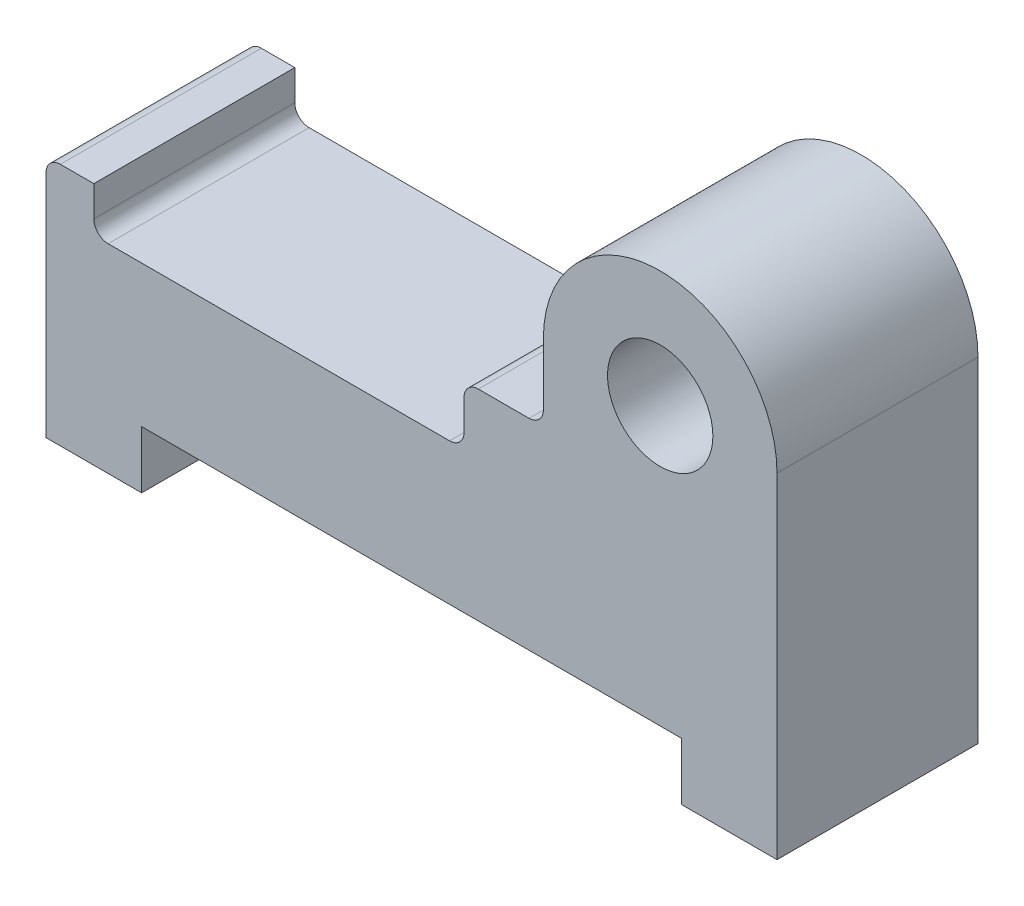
ISO-10303-21;
HEADER;
FILE_DESCRIPTION(('STEP AP214'),'2;1');
FILE_NAME('part.step','',(''),(''),'','','');
FILE_SCHEMA(('AUTOMOTIVE_DESIGN { 1 0 10303 214 1 1 1 1 }'));
ENDSEC;
DATA;
#1=APPLICATION_CONTEXT('core data for automotive mechanical design processes');
#2=APPLICATION_PROTOCOL_DEFINITION('international standard','automotive_design',2000,#1);
#3=PRODUCT_CONTEXT('',#1,'mechanical');
#4=PRODUCT('Part','Part','',(#3));
#5=PRODUCT_RELATED_PRODUCT_CATEGORY('part','',(#4));
#6=PRODUCT_DEFINITION_FORMATION('','',#4);
#7=PRODUCT_DEFINITION_CONTEXT('part definition',#1,'design');
#8=PRODUCT_DEFINITION('design','',#6,#7);
#9=PRODUCT_DEFINITION_SHAPE('','',#8);
#10=(LENGTH_UNIT() NAMED_UNIT(*) SI_UNIT(.MILLI.,.METRE.));
#11=(NAMED_UNIT(*) PLANE_ANGLE_UNIT() SI_UNIT($,.RADIAN.));
#12=(NAMED_UNIT(*) SI_UNIT($,.STERADIAN.) SOLID_ANGLE_UNIT());
#13=UNCERTAINTY_MEASURE_WITH_UNIT(LENGTH_MEASURE(1.E-05),#10,'distance_accuracy_value','');
#14=(GEOMETRIC_REPRESENTATION_CONTEXT(3) GLOBAL_UNCERTAINTY_ASSIGNED_CONTEXT((#13)) GLOBAL_UNIT_ASSIGNED_CONTEXT((#10,
#11,#12)) REPRESENTATION_CONTEXT('',''));
#15=CARTESIAN_POINT('',(0.,0.,0.));
#16=DIRECTION('',(0.,0.,1.));
#17=DIRECTION('',(1.,0.,0.));
#18=AXIS2_PLACEMENT_3D('',#15,#16,#17);
#19=CARTESIAN_POINT('',(128.425075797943,70.,42.0250999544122));
#20=DIRECTION('',(0.,0.,1.));
#21=DIRECTION('',(1.,0.,0.));
#22=AXIS2_PLACEMENT_3D('',#19,#20,#21);
#23=PLANE('',#22);
#24=DIRECTION('',(0.,-1.,0.));
#25=VECTOR('',#24,1.);
#26=CARTESIAN_POINT('',(0.,48.,42.0250999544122));
#27=LINE('',#26,#25);
#28=CARTESIAN_POINT('',(0.,48.,42.0250999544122));
#29=VERTEX_POINT('',#28);
#30=CARTESIAN_POINT('',(0.,0.,42.0250999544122));
#31=VERTEX_POINT('',#30);
#32=EDGE_CURVE('E232',#29,#31,#27,.T.);
#33=ORIENTED_EDGE('',*,*,#32,.T.);
#34=DIRECTION('',(1.,0.,0.));
#35=VECTOR('',#34,1.);
#36=CARTESIAN_POINT('',(0.,0.,42.0250999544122));
#37=LINE('',#36,#35);
#38=CARTESIAN_POINT('',(20.,0.,42.0250999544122));
#39=VERTEX_POINT('',#38);
#40=EDGE_CURVE('E125',#31,#39,#37,.T.);
#41=ORIENTED_EDGE('',*,*,#40,.T.);
#42=DIRECTION('',(0.,1.,0.));
#43=VECTOR('',#42,1.);
#44=CARTESIAN_POINT('',(20.,0.,42.0250999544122));
#45=LINE('',#44,#43);
#46=CARTESIAN_POINT('',(20.,12.,42.0250999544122));
#47=VERTEX_POINT('',#46);
#48=EDGE_CURVE('E280',#39,#47,#45,.T.);
#49=ORIENTED_EDGE('',*,*,#48,.T.);
#50=DIRECTION('',(1.,0.,0.));
#51=VECTOR('',#50,1.);
#52=CARTESIAN_POINT('',(20.,12.,42.0250999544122));
#53=LINE('',#52,#51);
#54=CARTESIAN_POINT('',(132.850151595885,12.,42.0250999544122));
#55=VERTEX_POINT('',#54);
#56=EDGE_CURVE('E299',#47,#55,#53,.T.);
#57=ORIENTED_EDGE('',*,*,#56,.T.);
#58=DIRECTION('',(0.,-1.,0.));
#59=VECTOR('',#58,1.);
#60=CARTESIAN_POINT('',(132.850151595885,12.,42.0250999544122));
#61=LINE('',#60,#59);
#62=CARTESIAN_POINT('',(132.850151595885,0.,42.0250999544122));
#63=VERTEX_POINT('',#62);
#64=EDGE_CURVE('E296',#55,#63,#61,.T.);
#65=ORIENTED_EDGE('',*,*,#64,.T.);
#66=DIRECTION('',(1.,0.,0.));
#67=VECTOR('',#66,1.);
#68=CARTESIAN_POINT('',(132.850151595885,0.,42.0250999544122));
#69=LINE('',#68,#67);
#70=CARTESIAN_POINT('',(152.850151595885,0.,42.0250999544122));
#71=VERTEX_POINT('',#70);
#72=EDGE_CURVE('E298',#63,#71,#69,.T.);
#73=ORIENTED_EDGE('',*,*,#72,.T.);
#74=DIRECTION('',(0.,1.,0.));
#75=VECTOR('',#74,1.);
#76=CARTESIAN_POINT('',(152.850151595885,0.,42.0250999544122));
#77=LINE('',#76,#75);
#78=CARTESIAN_POINT('',(152.850151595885,70.,42.0250999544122));
#79=VERTEX_POINT('',#78);
#80=EDGE_CURVE('E301',#71,#79,#77,.T.);
#81=ORIENTED_EDGE('',*,*,#80,.T.);
#82=CARTESIAN_POINT('',(128.425075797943,70.,42.0250999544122));
#83=DIRECTION('',(0.,0.,1.));
#84=DIRECTION('',(1.,0.,0.));
#85=AXIS2_PLACEMENT_3D('',#82,#83,#84);
#86=CIRCLE('',#85,24.4250757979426);
#87=CARTESIAN_POINT('',(104.,70.,42.0250999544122));
#88=VERTEX_POINT('',#87);
#89=EDGE_CURVE('E307',#79,#88,#86,.T.);
#90=ORIENTED_EDGE('',*,*,#89,.T.);
#91=DIRECTION('',(0.,-1.,0.));
#92=VECTOR('',#91,1.);
#93=CARTESIAN_POINT('',(104.,70.,42.0250999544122));
#94=LINE('',#93,#92);
#95=CARTESIAN_POINT('',(104.,57.,42.0250999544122));
#96=VERTEX_POINT('',#95);
#97=EDGE_CURVE('E309',#88,#96,#94,.T.);
#98=ORIENTED_EDGE('',*,*,#97,.T.);
#99=CARTESIAN_POINT('',(101.,57.,42.0250999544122));
#100=DIRECTION('',(0.,0.,-1.));
#101=DIRECTION('',(-1.,0.,0.));
#102=AXIS2_PLACEMENT_3D('',#99,#100,#101);
#103=CIRCLE('',#102,3.00000000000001);
#104=CARTESIAN_POINT('',(101.,54.,42.0250999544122));
#105=VERTEX_POINT('',#104);
#106=EDGE_CURVE('E311',#96,#105,#103,.T.);
#107=ORIENTED_EDGE('',*,*,#106,.T.);
#108=DIRECTION('',(-1.,0.,0.));
#109=VECTOR('',#108,1.);
#110=CARTESIAN_POINT('',(101.,54.,42.0250999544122));
#111=LINE('',#110,#109);
#112=CARTESIAN_POINT('',(90.3994983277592,54.,42.0250999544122));
#113=VERTEX_POINT('',#112);
#114=EDGE_CURVE('E313',#105,#113,#111,.T.);
#115=ORIENTED_EDGE('',*,*,#114,.T.);
#116=CARTESIAN_POINT('',(90.3994983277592,51.,42.0250999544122));
#117=DIRECTION('',(0.,0.,1.));
#118=DIRECTION('',(1.,0.,0.));
#119=AXIS2_PLACEMENT_3D('',#116,#117,#118);
#120=CIRCLE('',#119,3.);
#121=CARTESIAN_POINT('',(87.3994983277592,51.,42.0250999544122));
#122=VERTEX_POINT('',#121);
#123=EDGE_CURVE('E315',#113,#122,#120,.T.);
#124=ORIENTED_EDGE('',*,*,#123,.T.);
#125=DIRECTION('',(0.,-1.,0.));
#126=VECTOR('',#125,1.);
#127=CARTESIAN_POINT('',(87.3994983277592,51.,42.0250999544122));
#128=LINE('',#127,#126);
#129=CARTESIAN_POINT('',(87.3994983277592,44.6174543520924,42.0250999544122));
#130=VERTEX_POINT('',#129);
#131=EDGE_CURVE('E317',#122,#130,#128,.T.);
#132=ORIENTED_EDGE('',*,*,#131,.T.);
#133=CARTESIAN_POINT('',(84.3994983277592,44.6174543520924,42.0250999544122));
#134=DIRECTION('',(0.,0.,-1.));
#135=DIRECTION('',(-1.,0.,0.));
#136=AXIS2_PLACEMENT_3D('',#133,#134,#135);
#137=CIRCLE('',#136,3.);
#138=CARTESIAN_POINT('',(84.3994983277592,41.6174543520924,42.0250999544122));
#139=VERTEX_POINT('',#138);
#140=EDGE_CURVE('E319',#130,#139,#137,.T.);
#141=ORIENTED_EDGE('',*,*,#140,.T.);
#142=DIRECTION('',(-1.,0.,0.));
#143=VECTOR('',#142,1.);
#144=CARTESIAN_POINT('',(84.3994983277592,41.6174543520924,42.0250999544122));
#145=LINE('',#144,#143);
#146=CARTESIAN_POINT('',(13.,41.6174543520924,42.0250999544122));
#147=VERTEX_POINT('',#146);
#148=EDGE_CURVE('E321',#139,#147,#145,.T.);
#149=ORIENTED_EDGE('',*,*,#148,.T.);
#150=CARTESIAN_POINT('',(13.,44.6174543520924,42.0250999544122));
#151=DIRECTION('',(0.,0.,-1.));
#152=DIRECTION('',(-1.,0.,0.));
#153=AXIS2_PLACEMENT_3D('',#150,#151,#152);
#154=CIRCLE('',#153,3.);
#155=CARTESIAN_POINT('',(10.,44.6174543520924,42.0250999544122));
#156=VERTEX_POINT('',#155);
#157=EDGE_CURVE('E177',#147,#156,#154,.T.);
#158=ORIENTED_EDGE('',*,*,#157,.T.);
#159=DIRECTION('',(0.,1.,0.));
#160=VECTOR('',#159,1.);
#161=CARTESIAN_POINT('',(10.,44.6174543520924,42.0250999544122));
#162=LINE('',#161,#160);
#163=CARTESIAN_POINT('',(10.,51.,42.0250999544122));
#164=VERTEX_POINT('',#163);
#165=EDGE_CURVE('E171',#156,#164,#162,.T.);
#166=ORIENTED_EDGE('',*,*,#165,.T.);
#167=DIRECTION('',(-1.,0.,0.));
#168=VECTOR('',#167,1.);
#169=CARTESIAN_POINT('',(10.,51.,42.0250999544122));
#170=LINE('',#169,#168);
#171=CARTESIAN_POINT('',(3.,51.,42.0250999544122));
#172=VERTEX_POINT('',#171);
#173=EDGE_CURVE('E175',#164,#172,#170,.T.);
#174=ORIENTED_EDGE('',*,*,#173,.T.);
#175=CARTESIAN_POINT('',(3.,48.,42.0250999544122));
#176=DIRECTION('',(0.,0.,1.));
#177=DIRECTION('',(1.,0.,0.));
#178=AXIS2_PLACEMENT_3D('',#175,#176,#177);
#179=CIRCLE('',#178,3.);
#180=EDGE_CURVE('E49',#172,#29,#179,.T.);
#181=ORIENTED_EDGE('',*,*,#180,.T.);
#182=EDGE_LOOP('',(#33,#41,#49,#57,#65,#73,#81,#90,#98,#107,#115,#124,#132,#141,#149,#158,#166,
#174,#181));
#183=FACE_BOUND('',#182,.T.);
#184=CARTESIAN_POINT('',(128.425075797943,70.,42.0250999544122));
#185=DIRECTION('',(0.,0.,1.));
#186=DIRECTION('',(1.,0.,0.));
#187=AXIS2_PLACEMENT_3D('',#184,#185,#186);
#188=CIRCLE('',#187,11.0137221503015);
#189=CARTESIAN_POINT('',(139.438797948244,70.,42.0250999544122));
#190=VERTEX_POINT('',#189);
#191=EDGE_CURVE('E199',#190,#190,#188,.T.);
#192=ORIENTED_EDGE('',*,*,#191,.F.);
#193=EDGE_LOOP('',(#192));
#194=FACE_BOUND('',#193,.T.);
#195=ADVANCED_FACE('F32',(#183,#194),#23,.T.);
#196=CARTESIAN_POINT('',(128.425075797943,70.,0.));
#197=DIRECTION('',(0.,0.,1.));
#198=DIRECTION('',(1.,0.,0.));
#199=AXIS2_PLACEMENT_3D('',#196,#197,#198);
#200=PLANE('',#199);
#201=DIRECTION('',(0.,-1.,0.));
#202=VECTOR('',#201,1.);
#203=CARTESIAN_POINT('',(0.,48.,0.));
#204=LINE('',#203,#202);
#205=CARTESIAN_POINT('',(0.,48.,0.));
#206=VERTEX_POINT('',#205);
#207=CARTESIAN_POINT('',(0.,0.,0.));
#208=VERTEX_POINT('',#207);
#209=EDGE_CURVE('E195',#206,#208,#204,.T.);
#210=ORIENTED_EDGE('',*,*,#209,.F.);
#211=CARTESIAN_POINT('',(3.,48.,0.));
#212=DIRECTION('',(0.,0.,1.));
#213=DIRECTION('',(1.,0.,0.));
#214=AXIS2_PLACEMENT_3D('',#211,#212,#213);
#215=CIRCLE('',#214,3.);
#216=CARTESIAN_POINT('',(3.,51.,0.));
#217=VERTEX_POINT('',#216);
#218=EDGE_CURVE('E117',#217,#206,#215,.T.);
#219=ORIENTED_EDGE('',*,*,#218,.F.);
#220=DIRECTION('',(-1.,0.,0.));
#221=VECTOR('',#220,1.);
#222=CARTESIAN_POINT('',(10.,51.,0.));
#223=LINE('',#222,#221);
#224=CARTESIAN_POINT('',(10.,51.,0.));
#225=VERTEX_POINT('',#224);
#226=EDGE_CURVE('E111',#225,#217,#223,.T.);
#227=ORIENTED_EDGE('',*,*,#226,.F.);
#228=DIRECTION('',(0.,1.,0.));
#229=VECTOR('',#228,1.);
#230=CARTESIAN_POINT('',(10.,44.6174543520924,0.));
#231=LINE('',#230,#229);
#232=CARTESIAN_POINT('',(10.,44.6174543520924,0.));
#233=VERTEX_POINT('',#232);
#234=EDGE_CURVE('E185',#233,#225,#231,.T.);
#235=ORIENTED_EDGE('',*,*,#234,.F.);
#236=CARTESIAN_POINT('',(13.,44.6174543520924,0.));
#237=DIRECTION('',(0.,0.,-1.));
#238=DIRECTION('',(-1.,0.,0.));
#239=AXIS2_PLACEMENT_3D('',#236,#237,#238);
#240=CIRCLE('',#239,3.);
#241=CARTESIAN_POINT('',(13.,41.6174543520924,0.));
#242=VERTEX_POINT('',#241);
#243=EDGE_CURVE('E227',#242,#233,#240,.T.);
#244=ORIENTED_EDGE('',*,*,#243,.F.);
#245=DIRECTION('',(-1.,0.,0.));
#246=VECTOR('',#245,1.);
#247=CARTESIAN_POINT('',(84.3994983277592,41.6174543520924,0.));
#248=LINE('',#247,#246);
#249=CARTESIAN_POINT('',(84.3994983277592,41.6174543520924,0.));
#250=VERTEX_POINT('',#249);
#251=EDGE_CURVE('E225',#250,#242,#248,.T.);
#252=ORIENTED_EDGE('',*,*,#251,.F.);
#253=CARTESIAN_POINT('',(84.3994983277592,44.6174543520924,0.));
#254=DIRECTION('',(0.,0.,-1.));
#255=DIRECTION('',(-1.,0.,0.));
#256=AXIS2_PLACEMENT_3D('',#253,#254,#255);
#257=CIRCLE('',#256,3.);
#258=CARTESIAN_POINT('',(87.3994983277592,44.6174543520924,0.));
#259=VERTEX_POINT('',#258);
#260=EDGE_CURVE('E223',#259,#250,#257,.T.);
#261=ORIENTED_EDGE('',*,*,#260,.F.);
#262=DIRECTION('',(0.,-1.,0.));
#263=VECTOR('',#262,1.);
#264=CARTESIAN_POINT('',(87.3994983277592,51.,0.));
#265=LINE('',#264,#263);
#266=CARTESIAN_POINT('',(87.3994983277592,51.,0.));
#267=VERTEX_POINT('',#266);
#268=EDGE_CURVE('E221',#267,#259,#265,.T.);
#269=ORIENTED_EDGE('',*,*,#268,.F.);
#270=CARTESIAN_POINT('',(90.3994983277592,51.,0.));
#271=DIRECTION('',(0.,0.,1.));
#272=DIRECTION('',(1.,0.,0.));
#273=AXIS2_PLACEMENT_3D('',#270,#271,#272);
#274=CIRCLE('',#273,3.);
#275=CARTESIAN_POINT('',(90.3994983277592,54.,0.));
#276=VERTEX_POINT('',#275);
#277=EDGE_CURVE('E219',#276,#267,#274,.T.);
#278=ORIENTED_EDGE('',*,*,#277,.F.);
#279=DIRECTION('',(-1.,0.,0.));
#280=VECTOR('',#279,1.);
#281=CARTESIAN_POINT('',(101.,54.,0.));
#282=LINE('',#281,#280);
#283=CARTESIAN_POINT('',(101.,54.,0.));
#284=VERTEX_POINT('',#283);
#285=EDGE_CURVE('E217',#284,#276,#282,.T.);
#286=ORIENTED_EDGE('',*,*,#285,.F.);
#287=CARTESIAN_POINT('',(101.,57.,0.));
#288=DIRECTION('',(0.,0.,-1.));
#289=DIRECTION('',(-1.,0.,0.));
#290=AXIS2_PLACEMENT_3D('',#287,#288,#289);
#291=CIRCLE('',#290,3.00000000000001);
#292=CARTESIAN_POINT('',(104.,57.,0.));
#293=VERTEX_POINT('',#292);
#294=EDGE_CURVE('E215',#293,#284,#291,.T.);
#295=ORIENTED_EDGE('',*,*,#294,.F.);
#296=DIRECTION('',(0.,-1.,0.));
#297=VECTOR('',#296,1.);
#298=CARTESIAN_POINT('',(104.,70.,0.));
#299=LINE('',#298,#297);
#300=CARTESIAN_POINT('',(104.,70.,0.));
#301=VERTEX_POINT('',#300);
#302=EDGE_CURVE('E213',#301,#293,#299,.T.);
#303=ORIENTED_EDGE('',*,*,#302,.F.);
#304=CARTESIAN_POINT('',(128.425075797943,70.,0.));
#305=DIRECTION('',(0.,0.,1.));
#306=DIRECTION('',(1.,0.,0.));
#307=AXIS2_PLACEMENT_3D('',#304,#305,#306);
#308=CIRCLE('',#307,24.4250757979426);
#309=CARTESIAN_POINT('',(152.850151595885,70.,0.));
#310=VERTEX_POINT('',#309);
#311=EDGE_CURVE('E211',#310,#301,#308,.T.);
#312=ORIENTED_EDGE('',*,*,#311,.F.);
#313=DIRECTION('',(0.,1.,0.));
#314=VECTOR('',#313,1.);
#315=CARTESIAN_POINT('',(152.850151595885,0.,0.));
#316=LINE('',#315,#314);
#317=CARTESIAN_POINT('',(152.850151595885,0.,0.));
#318=VERTEX_POINT('',#317);
#319=EDGE_CURVE('E209',#318,#310,#316,.T.);
#320=ORIENTED_EDGE('',*,*,#319,.F.);
#321=DIRECTION('',(1.,0.,0.));
#322=VECTOR('',#321,1.);
#323=CARTESIAN_POINT('',(132.850151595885,0.,0.));
#324=LINE('',#323,#322);
#325=CARTESIAN_POINT('',(132.850151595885,0.,0.));
#326=VERTEX_POINT('',#325);
#327=EDGE_CURVE('E207',#326,#318,#324,.T.);
#328=ORIENTED_EDGE('',*,*,#327,.F.);
#329=DIRECTION('',(0.,-1.,0.));
#330=VECTOR('',#329,1.);
#331=CARTESIAN_POINT('',(132.850151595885,12.,0.));
#332=LINE('',#331,#330);
#333=CARTESIAN_POINT('',(132.850151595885,12.,0.));
#334=VERTEX_POINT('',#333);
#335=EDGE_CURVE('E205',#334,#326,#332,.T.);
#336=ORIENTED_EDGE('',*,*,#335,.F.);
#337=DIRECTION('',(1.,0.,0.));
#338=VECTOR('',#337,1.);
#339=CARTESIAN_POINT('',(20.,12.,0.));
#340=LINE('',#339,#338);
#341=CARTESIAN_POINT('',(20.,12.,0.));
#342=VERTEX_POINT('',#341);
#343=EDGE_CURVE('E203',#342,#334,#340,.T.);
#344=ORIENTED_EDGE('',*,*,#343,.F.);
#345=DIRECTION('',(0.,1.,0.));
#346=VECTOR('',#345,1.);
#347=CARTESIAN_POINT('',(20.,0.,0.));
#348=LINE('',#347,#346);
#349=CARTESIAN_POINT('',(20.,0.,0.));
#350=VERTEX_POINT('',#349);
#351=EDGE_CURVE('E201',#350,#342,#348,.T.);
#352=ORIENTED_EDGE('',*,*,#351,.F.);
#353=DIRECTION('',(1.,0.,0.));
#354=VECTOR('',#353,1.);
#355=CARTESIAN_POINT('',(0.,0.,0.));
#356=LINE('',#355,#354);
#357=EDGE_CURVE('E198',#208,#350,#356,.T.);
#358=ORIENTED_EDGE('',*,*,#357,.F.);
#359=EDGE_LOOP('',(#210,#219,#227,#235,#244,#252,#261,#269,#278,#286,#295,#303,#312,#320,#328,
#336,#344,#352,#358));
#360=FACE_BOUND('',#359,.T.);
#361=CARTESIAN_POINT('',(128.425075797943,70.,0.));
#362=DIRECTION('',(0.,0.,1.));
#363=DIRECTION('',(1.,0.,0.));
#364=AXIS2_PLACEMENT_3D('',#361,#362,#363);
#365=CIRCLE('',#364,11.0137221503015);
#366=CARTESIAN_POINT('',(139.438797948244,70.,0.));
#367=VERTEX_POINT('',#366);
#368=EDGE_CURVE('E559',#367,#367,#365,.T.);
#369=ORIENTED_EDGE('',*,*,#368,.T.);
#370=EDGE_LOOP('',(#369));
#371=FACE_BOUND('',#370,.T.);
#372=ADVANCED_FACE('F284',(#360,#371),#200,.F.);
#373=CARTESIAN_POINT('',(0.,48.,42.0250999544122));
#374=DIRECTION('',(1.,0.,0.));
#375=DIRECTION('',(0.,1.,0.));
#376=AXIS2_PLACEMENT_3D('',#373,#374,#375);
#377=PLANE('',#376);
#378=ORIENTED_EDGE('',*,*,#209,.T.);
#379=DIRECTION('',(0.,0.,-1.));
#380=VECTOR('',#379,1.);
#381=CARTESIAN_POINT('',(0.,0.,42.0250999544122));
#382=LINE('',#381,#380);
#383=EDGE_CURVE('E11',#31,#208,#382,.T.);
#384=ORIENTED_EDGE('',*,*,#383,.F.);
#385=ORIENTED_EDGE('',*,*,#32,.F.);
#386=DIRECTION('',(0.,0.,-1.));
#387=VECTOR('',#386,1.);
#388=CARTESIAN_POINT('',(0.,48.,42.0250999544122));
#389=LINE('',#388,#387);
#390=EDGE_CURVE('E191',#29,#206,#389,.T.);
#391=ORIENTED_EDGE('',*,*,#390,.T.);
#392=EDGE_LOOP('',(#378,#384,#385,#391));
#393=FACE_BOUND('',#392,.T.);
#394=ADVANCED_FACE('F34',(#393),#377,.F.);
#395=CARTESIAN_POINT('',(0.,0.,42.0250999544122));
#396=DIRECTION('',(0.,1.,0.));
#397=DIRECTION('',(0.,0.,1.));
#398=AXIS2_PLACEMENT_3D('',#395,#396,#397);
#399=PLANE('',#398);
#400=ORIENTED_EDGE('',*,*,#357,.T.);
#401=DIRECTION('',(0.,0.,-1.));
#402=VECTOR('',#401,1.);
#403=CARTESIAN_POINT('',(20.,0.,42.0250999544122));
#404=LINE('',#403,#402);
#405=EDGE_CURVE('E41',#39,#350,#404,.T.);
#406=ORIENTED_EDGE('',*,*,#405,.F.);
#407=ORIENTED_EDGE('',*,*,#40,.F.);
#408=ORIENTED_EDGE('',*,*,#383,.T.);
#409=EDGE_LOOP('',(#400,#406,#407,#408));
#410=FACE_BOUND('',#409,.T.);
#411=ADVANCED_FACE('F355',(#410),#399,.F.);
#412=CARTESIAN_POINT('',(20.,0.,42.0250999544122));
#413=DIRECTION('',(-1.,0.,0.));
#414=DIRECTION('',(0.,0.,1.));
#415=AXIS2_PLACEMENT_3D('',#412,#413,#414);
#416=PLANE('',#415);
#417=ORIENTED_EDGE('',*,*,#351,.T.);
#418=DIRECTION('',(0.,0.,-1.));
#419=VECTOR('',#418,1.);
#420=CARTESIAN_POINT('',(20.,12.,42.0250999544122));
#421=LINE('',#420,#419);
#422=EDGE_CURVE('E272',#47,#342,#421,.T.);
#423=ORIENTED_EDGE('',*,*,#422,.F.);
#424=ORIENTED_EDGE('',*,*,#48,.F.);
#425=ORIENTED_EDGE('',*,*,#405,.T.);
#426=EDGE_LOOP('',(#417,#423,#424,#425));
#427=FACE_BOUND('',#426,.T.);
#428=ADVANCED_FACE('F278',(#427),#416,.F.);
#429=CARTESIAN_POINT('',(20.,12.,42.0250999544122));
#430=DIRECTION('',(0.,1.,0.));
#431=DIRECTION('',(0.,0.,1.));
#432=AXIS2_PLACEMENT_3D('',#429,#430,#431);
#433=PLANE('',#432);
#434=ORIENTED_EDGE('',*,*,#343,.T.);
#435=DIRECTION('',(0.,0.,-1.));
#436=VECTOR('',#435,1.);
#437=CARTESIAN_POINT('',(132.850151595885,12.,42.0250999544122));
#438=LINE('',#437,#436);
#439=EDGE_CURVE('E269',#55,#334,#438,.T.);
#440=ORIENTED_EDGE('',*,*,#439,.F.);
#441=ORIENTED_EDGE('',*,*,#56,.F.);
#442=ORIENTED_EDGE('',*,*,#422,.T.);
#443=EDGE_LOOP('',(#434,#440,#441,#442));
#444=FACE_BOUND('',#443,.T.);
#445=ADVANCED_FACE('F290',(#444),#433,.F.);
#446=CARTESIAN_POINT('',(132.850151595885,12.,42.0250999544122));
#447=DIRECTION('',(1.,0.,0.));
#448=DIRECTION('',(0.,0.,-1.));
#449=AXIS2_PLACEMENT_3D('',#446,#447,#448);
#450=PLANE('',#449);
#451=ORIENTED_EDGE('',*,*,#335,.T.);
#452=DIRECTION('',(0.,0.,-1.));
#453=VECTOR('',#452,1.);
#454=CARTESIAN_POINT('',(132.850151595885,0.,42.0250999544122));
#455=LINE('',#454,#453);
#456=EDGE_CURVE('E266',#63,#326,#455,.T.);
#457=ORIENTED_EDGE('',*,*,#456,.F.);
#458=ORIENTED_EDGE('',*,*,#64,.F.);
#459=ORIENTED_EDGE('',*,*,#439,.T.);
#460=EDGE_LOOP('',(#451,#457,#458,#459));
#461=FACE_BOUND('',#460,.T.);
#462=ADVANCED_FACE('F294',(#461),#450,.F.);
#463=CARTESIAN_POINT('',(132.850151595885,0.,42.0250999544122));
#464=DIRECTION('',(0.,1.,0.));
#465=DIRECTION('',(0.,0.,1.));
#466=AXIS2_PLACEMENT_3D('',#463,#464,#465);
#467=PLANE('',#466);
#468=ORIENTED_EDGE('',*,*,#327,.T.);
#469=DIRECTION('',(0.,0.,-1.));
#470=VECTOR('',#469,1.);
#471=CARTESIAN_POINT('',(152.850151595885,0.,42.0250999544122));
#472=LINE('',#471,#470);
#473=EDGE_CURVE('E263',#71,#318,#472,.T.);
#474=ORIENTED_EDGE('',*,*,#473,.F.);
#475=ORIENTED_EDGE('',*,*,#72,.F.);
#476=ORIENTED_EDGE('',*,*,#456,.T.);
#477=EDGE_LOOP('',(#468,#474,#475,#476));
#478=FACE_BOUND('',#477,.T.);
#479=ADVANCED_FACE('F368',(#478),#467,.F.);
#480=CARTESIAN_POINT('',(152.850151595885,0.,42.0250999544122));
#481=DIRECTION('',(-1.,0.,0.));
#482=DIRECTION('',(0.,-1.,0.));
#483=AXIS2_PLACEMENT_3D('',#480,#481,#482);
#484=PLANE('',#483);
#485=ORIENTED_EDGE('',*,*,#319,.T.);
#486=DIRECTION('',(0.,0.,-1.));
#487=VECTOR('',#486,1.);
#488=CARTESIAN_POINT('',(152.850151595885,70.,42.0250999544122));
#489=LINE('',#488,#487);
#490=EDGE_CURVE('E260',#79,#310,#489,.T.);
#491=ORIENTED_EDGE('',*,*,#490,.F.);
#492=ORIENTED_EDGE('',*,*,#80,.F.);
#493=ORIENTED_EDGE('',*,*,#473,.T.);
#494=EDGE_LOOP('',(#485,#491,#492,#493));
#495=FACE_BOUND('',#494,.T.);
#496=ADVANCED_FACE('F371',(#495),#484,.F.);
#497=CARTESIAN_POINT('',(128.425075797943,70.,42.0250999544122));
#498=DIRECTION('',(0.,0.,-1.));
#499=DIRECTION('',(-1.,0.,0.));
#500=AXIS2_PLACEMENT_3D('',#497,#498,#499);
#501=CYLINDRICAL_SURFACE('',#500,24.4250757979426);
#502=ORIENTED_EDGE('',*,*,#311,.T.);
#503=DIRECTION('',(0.,0.,-1.));
#504=VECTOR('',#503,1.);
#505=CARTESIAN_POINT('',(104.,70.,42.0250999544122));
#506=LINE('',#505,#504);
#507=EDGE_CURVE('E257',#88,#301,#506,.T.);
#508=ORIENTED_EDGE('',*,*,#507,.F.);
#509=ORIENTED_EDGE('',*,*,#89,.F.);
#510=ORIENTED_EDGE('',*,*,#490,.T.);
#511=EDGE_LOOP('',(#502,#508,#509,#510));
#512=FACE_BOUND('',#511,.T.);
#513=ADVANCED_FACE('F375',(#512),#501,.T.);
#514=CARTESIAN_POINT('',(104.,70.,42.0250999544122));
#515=DIRECTION('',(1.,0.,0.));
#516=DIRECTION('',(0.,1.,0.));
#517=AXIS2_PLACEMENT_3D('',#514,#515,#516);
#518=PLANE('',#517);
#519=ORIENTED_EDGE('',*,*,#302,.T.);
#520=DIRECTION('',(0.,0.,-1.));
#521=VECTOR('',#520,1.);
#522=CARTESIAN_POINT('',(104.,57.,42.0250999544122));
#523=LINE('',#522,#521);
#524=EDGE_CURVE('E254',#96,#293,#523,.T.);
#525=ORIENTED_EDGE('',*,*,#524,.F.);
#526=ORIENTED_EDGE('',*,*,#97,.F.);
#527=ORIENTED_EDGE('',*,*,#507,.T.);
#528=EDGE_LOOP('',(#519,#525,#526,#527));
#529=FACE_BOUND('',#528,.T.);
#530=ADVANCED_FACE('F379',(#529),#518,.F.);
#531=CARTESIAN_POINT('',(101.,57.,42.0250999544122));
#532=DIRECTION('',(0.,0.,-1.));
#533=DIRECTION('',(-1.,0.,0.));
#534=AXIS2_PLACEMENT_3D('',#531,#532,#533);
#535=CYLINDRICAL_SURFACE('',#534,3.00000000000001);
#536=ORIENTED_EDGE('',*,*,#294,.T.);
#537=DIRECTION('',(0.,0.,-1.));
#538=VECTOR('',#537,1.);
#539=CARTESIAN_POINT('',(101.,54.,42.0250999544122));
#540=LINE('',#539,#538);
#541=EDGE_CURVE('E251',#105,#284,#540,.T.);
#542=ORIENTED_EDGE('',*,*,#541,.F.);
#543=ORIENTED_EDGE('',*,*,#106,.F.);
#544=ORIENTED_EDGE('',*,*,#524,.T.);
#545=EDGE_LOOP('',(#536,#542,#543,#544));
#546=FACE_BOUND('',#545,.T.);
#547=ADVANCED_FACE('F383',(#546),#535,.F.);
#548=CARTESIAN_POINT('',(101.,54.,42.0250999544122));
#549=DIRECTION('',(0.,-1.,0.));
#550=DIRECTION('',(1.,0.,0.));
#551=AXIS2_PLACEMENT_3D('',#548,#549,#550);
#552=PLANE('',#551);
#553=ORIENTED_EDGE('',*,*,#285,.T.);
#554=DIRECTION('',(0.,0.,-1.));
#555=VECTOR('',#554,1.);
#556=CARTESIAN_POINT('',(90.3994983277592,54.,42.0250999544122));
#557=LINE('',#556,#555);
#558=EDGE_CURVE('E248',#113,#276,#557,.T.);
#559=ORIENTED_EDGE('',*,*,#558,.F.);
#560=ORIENTED_EDGE('',*,*,#114,.F.);
#561=ORIENTED_EDGE('',*,*,#541,.T.);
#562=EDGE_LOOP('',(#553,#559,#560,#561));
#563=FACE_BOUND('',#562,.T.);
#564=ADVANCED_FACE('F387',(#563),#552,.F.);
#565=CARTESIAN_POINT('',(90.3994983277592,51.,42.0250999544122));
#566=DIRECTION('',(0.,0.,-1.));
#567=DIRECTION('',(-1.,0.,0.));
#568=AXIS2_PLACEMENT_3D('',#565,#566,#567);
#569=CYLINDRICAL_SURFACE('',#568,3.);
#570=ORIENTED_EDGE('',*,*,#277,.T.);
#571=DIRECTION('',(0.,0.,-1.));
#572=VECTOR('',#571,1.);
#573=CARTESIAN_POINT('',(87.3994983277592,51.,42.0250999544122));
#574=LINE('',#573,#572);
#575=EDGE_CURVE('E245',#122,#267,#574,.T.);
#576=ORIENTED_EDGE('',*,*,#575,.F.);
#577=ORIENTED_EDGE('',*,*,#123,.F.);
#578=ORIENTED_EDGE('',*,*,#558,.T.);
#579=EDGE_LOOP('',(#570,#576,#577,#578));
#580=FACE_BOUND('',#579,.T.);
#581=ADVANCED_FACE('F391',(#580),#569,.T.);
#582=CARTESIAN_POINT('',(87.3994983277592,51.,42.0250999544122));
#583=DIRECTION('',(1.,0.,0.));
#584=DIRECTION('',(0.,0.,-1.));
#585=AXIS2_PLACEMENT_3D('',#582,#583,#584);
#586=PLANE('',#585);
#587=ORIENTED_EDGE('',*,*,#268,.T.);
#588=DIRECTION('',(0.,0.,-1.));
#589=VECTOR('',#588,1.);
#590=CARTESIAN_POINT('',(87.3994983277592,44.6174543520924,42.0250999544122));
#591=LINE('',#590,#589);
#592=EDGE_CURVE('E242',#130,#259,#591,.T.);
#593=ORIENTED_EDGE('',*,*,#592,.F.);
#594=ORIENTED_EDGE('',*,*,#131,.F.);
#595=ORIENTED_EDGE('',*,*,#575,.T.);
#596=EDGE_LOOP('',(#587,#593,#594,#595));
#597=FACE_BOUND('',#596,.T.);
#598=ADVANCED_FACE('F395',(#597),#586,.F.);
#599=CARTESIAN_POINT('',(84.3994983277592,44.6174543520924,42.0250999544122));
#600=DIRECTION('',(0.,0.,-1.));
#601=DIRECTION('',(-1.,0.,0.));
#602=AXIS2_PLACEMENT_3D('',#599,#600,#601);
#603=CYLINDRICAL_SURFACE('',#602,3.);
#604=ORIENTED_EDGE('',*,*,#260,.T.);
#605=DIRECTION('',(0.,0.,-1.));
#606=VECTOR('',#605,1.);
#607=CARTESIAN_POINT('',(84.3994983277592,41.6174543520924,42.0250999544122));
#608=LINE('',#607,#606);
#609=EDGE_CURVE('E239',#139,#250,#608,.T.);
#610=ORIENTED_EDGE('',*,*,#609,.F.);
#611=ORIENTED_EDGE('',*,*,#140,.F.);
#612=ORIENTED_EDGE('',*,*,#592,.T.);
#613=EDGE_LOOP('',(#604,#610,#611,#612));
#614=FACE_BOUND('',#613,.T.);
#615=ADVANCED_FACE('F399',(#614),#603,.F.);
#616=CARTESIAN_POINT('',(84.3994983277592,41.6174543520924,42.0250999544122));
#617=DIRECTION('',(0.,-1.,0.));
#618=DIRECTION('',(1.,0.,0.));
#619=AXIS2_PLACEMENT_3D('',#616,#617,#618);
#620=PLANE('',#619);
#621=ORIENTED_EDGE('',*,*,#251,.T.);
#622=DIRECTION('',(0.,0.,-1.));
#623=VECTOR('',#622,1.);
#624=CARTESIAN_POINT('',(13.,41.6174543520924,42.0250999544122));
#625=LINE('',#624,#623);
#626=EDGE_CURVE('E236',#147,#242,#625,.T.);
#627=ORIENTED_EDGE('',*,*,#626,.F.);
#628=ORIENTED_EDGE('',*,*,#148,.F.);
#629=ORIENTED_EDGE('',*,*,#609,.T.);
#630=EDGE_LOOP('',(#621,#627,#628,#629));
#631=FACE_BOUND('',#630,.T.);
#632=ADVANCED_FACE('F327',(#631),#620,.F.);
#633=CARTESIAN_POINT('',(13.,44.6174543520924,42.0250999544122));
#634=DIRECTION('',(0.,0.,-1.));
#635=DIRECTION('',(-1.,0.,0.));
#636=AXIS2_PLACEMENT_3D('',#633,#634,#635);
#637=CYLINDRICAL_SURFACE('',#636,3.);
#638=ORIENTED_EDGE('',*,*,#243,.T.);
#639=DIRECTION('',(0.,0.,-1.));
#640=VECTOR('',#639,1.);
#641=CARTESIAN_POINT('',(10.,44.6174543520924,42.0250999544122));
#642=LINE('',#641,#640);
#643=EDGE_CURVE('E186',#156,#233,#642,.T.);
#644=ORIENTED_EDGE('',*,*,#643,.F.);
#645=ORIENTED_EDGE('',*,*,#157,.F.);
#646=ORIENTED_EDGE('',*,*,#626,.T.);
#647=EDGE_LOOP('',(#638,#644,#645,#646));
#648=FACE_BOUND('',#647,.T.);
#649=ADVANCED_FACE('F331',(#648),#637,.F.);
#650=CARTESIAN_POINT('',(10.,44.6174543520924,42.0250999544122));
#651=DIRECTION('',(-1.,0.,0.));
#652=DIRECTION('',(0.,0.,1.));
#653=AXIS2_PLACEMENT_3D('',#650,#651,#652);
#654=PLANE('',#653);
#655=ORIENTED_EDGE('',*,*,#234,.T.);
#656=DIRECTION('',(0.,0.,-1.));
#657=VECTOR('',#656,1.);
#658=CARTESIAN_POINT('',(10.,51.,42.0250999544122));
#659=LINE('',#658,#657);
#660=EDGE_CURVE('E182',#164,#225,#659,.T.);
#661=ORIENTED_EDGE('',*,*,#660,.F.);
#662=ORIENTED_EDGE('',*,*,#165,.F.);
#663=ORIENTED_EDGE('',*,*,#643,.T.);
#664=EDGE_LOOP('',(#655,#661,#662,#663));
#665=FACE_BOUND('',#664,.T.);
#666=ADVANCED_FACE('F183',(#665),#654,.F.);
#667=CARTESIAN_POINT('',(10.,51.,42.0250999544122));
#668=DIRECTION('',(0.,-1.,0.));
#669=DIRECTION('',(0.,0.,-1.));
#670=AXIS2_PLACEMENT_3D('',#667,#668,#669);
#671=PLANE('',#670);
#672=ORIENTED_EDGE('',*,*,#226,.T.);
#673=DIRECTION('',(0.,0.,-1.));
#674=VECTOR('',#673,1.);
#675=CARTESIAN_POINT('',(3.,51.,42.0250999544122));
#676=LINE('',#675,#674);
#677=EDGE_CURVE('E187',#172,#217,#676,.T.);
#678=ORIENTED_EDGE('',*,*,#677,.F.);
#679=ORIENTED_EDGE('',*,*,#173,.F.);
#680=ORIENTED_EDGE('',*,*,#660,.T.);
#681=EDGE_LOOP('',(#672,#678,#679,#680));
#682=FACE_BOUND('',#681,.T.);
#683=ADVANCED_FACE('F189',(#682),#671,.F.);
#684=CARTESIAN_POINT('',(3.,48.,42.0250999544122));
#685=DIRECTION('',(0.,0.,-1.));
#686=DIRECTION('',(-1.,0.,0.));
#687=AXIS2_PLACEMENT_3D('',#684,#685,#686);
#688=CYLINDRICAL_SURFACE('',#687,3.);
#689=ORIENTED_EDGE('',*,*,#218,.T.);
#690=ORIENTED_EDGE('',*,*,#390,.F.);
#691=ORIENTED_EDGE('',*,*,#180,.F.);
#692=ORIENTED_EDGE('',*,*,#677,.T.);
#693=EDGE_LOOP('',(#689,#690,#691,#692));
#694=FACE_BOUND('',#693,.T.);
#695=ADVANCED_FACE('F335',(#694),#688,.T.);
#696=CARTESIAN_POINT('',(128.425075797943,70.,42.0250999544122));
#697=DIRECTION('',(0.,0.,-1.));
#698=DIRECTION('',(-1.,0.,0.));
#699=AXIS2_PLACEMENT_3D('',#696,#697,#698);
#700=CYLINDRICAL_SURFACE('',#699,11.0137221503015);
#701=ORIENTED_EDGE('',*,*,#191,.T.);
#702=EDGE_LOOP('',(#701));
#703=FACE_BOUND('',#702,.T.);
#704=ORIENTED_EDGE('',*,*,#368,.F.);
#705=EDGE_LOOP('',(#704));
#706=FACE_BOUND('',#705,.T.);
#707=ADVANCED_FACE('F337',(#703,#706),#700,.F.);
#708=CLOSED_SHELL('',(#195,#372,#394,#411,#428,#445,#462,#479,#496,#513,#530,#547,#564,#581,
#598,#615,#632,#649,#666,#683,#695,#707));
#709=MANIFOLD_SOLID_BREP('B2',#708);
#710=ADVANCED_BREP_SHAPE_REPRESENTATION('',(#18,#709),#14);
#711=SHAPE_DEFINITION_REPRESENTATION(#9,#710);
ENDSEC;
END-ISO-10303-21;
